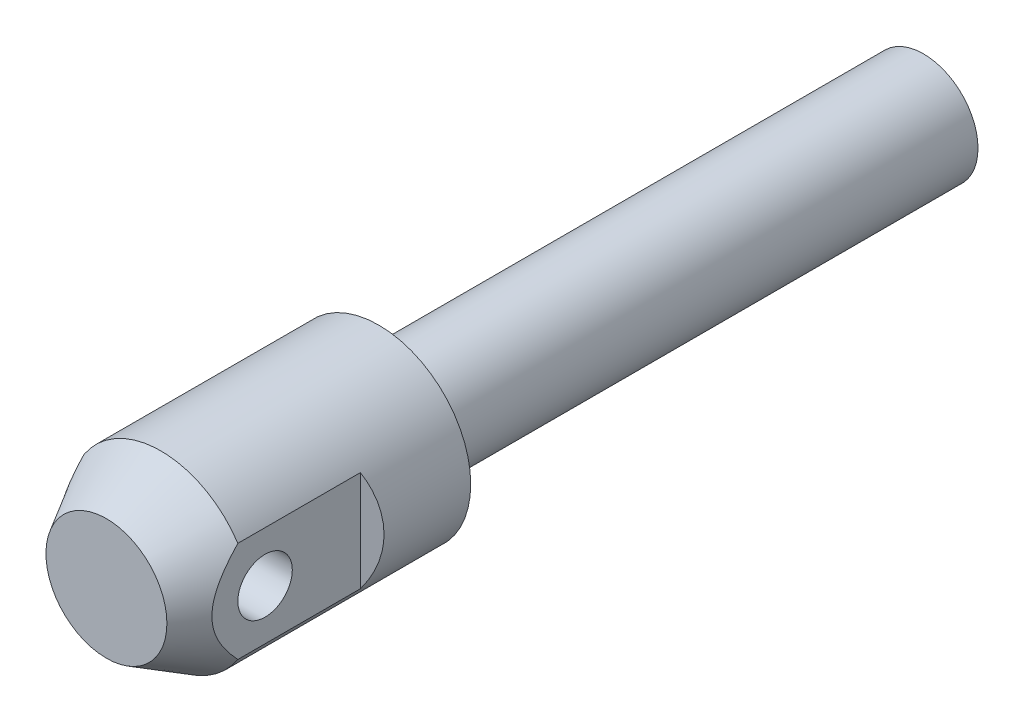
ISO-10303-21;
HEADER;
FILE_DESCRIPTION(('STEP AP214'),'2;1');
FILE_NAME('part.step','',(''),(''),'','','');
FILE_SCHEMA(('AUTOMOTIVE_DESIGN { 1 0 10303 214 1 1 1 1 }'));
ENDSEC;
DATA;
#1=APPLICATION_CONTEXT('core data for automotive mechanical design processes');
#2=APPLICATION_PROTOCOL_DEFINITION('international standard','automotive_design',2000,#1);
#3=PRODUCT_CONTEXT('',#1,'mechanical');
#4=PRODUCT('Part','Part','',(#3));
#5=PRODUCT_RELATED_PRODUCT_CATEGORY('part','',(#4));
#6=PRODUCT_DEFINITION_FORMATION('','',#4);
#7=PRODUCT_DEFINITION_CONTEXT('part definition',#1,'design');
#8=PRODUCT_DEFINITION('design','',#6,#7);
#9=PRODUCT_DEFINITION_SHAPE('','',#8);
#10=(LENGTH_UNIT() NAMED_UNIT(*) SI_UNIT(.MILLI.,.METRE.));
#11=(NAMED_UNIT(*) PLANE_ANGLE_UNIT() SI_UNIT($,.RADIAN.));
#12=(NAMED_UNIT(*) SI_UNIT($,.STERADIAN.) SOLID_ANGLE_UNIT());
#13=UNCERTAINTY_MEASURE_WITH_UNIT(LENGTH_MEASURE(1.E-05),#10,'distance_accuracy_value','');
#14=(GEOMETRIC_REPRESENTATION_CONTEXT(3) GLOBAL_UNCERTAINTY_ASSIGNED_CONTEXT((#13)) GLOBAL_UNIT_ASSIGNED_CONTEXT((#10,
#11,#12)) REPRESENTATION_CONTEXT('',''));
#15=CARTESIAN_POINT('',(0.,0.,0.));
#16=DIRECTION('',(0.,0.,1.));
#17=DIRECTION('',(1.,0.,0.));
#18=AXIS2_PLACEMENT_3D('',#15,#16,#17);
#19=CARTESIAN_POINT('',(0.,0.,20.));
#20=DIRECTION('',(0.,0.,1.));
#21=DIRECTION('',(1.,0.,0.));
#22=AXIS2_PLACEMENT_3D('',#19,#20,#21);
#23=CYLINDRICAL_SURFACE('',#22,13.5);
#24=CARTESIAN_POINT('',(0.,0.,0.));
#25=DIRECTION('',(0.,0.,1.));
#26=DIRECTION('',(1.,0.,0.));
#27=AXIS2_PLACEMENT_3D('',#24,#25,#26);
#28=CIRCLE('',#27,13.5);
#29=CARTESIAN_POINT('',(13.5,0.,0.));
#30=VERTEX_POINT('',#29);
#31=EDGE_CURVE('E82',#30,#30,#28,.T.);
#32=ORIENTED_EDGE('',*,*,#31,.T.);
#33=EDGE_LOOP('',(#32));
#34=FACE_BOUND('',#33,.T.);
#35=CARTESIAN_POINT('',(0.,0.,32.));
#36=DIRECTION('',(0.,0.,1.));
#37=DIRECTION('',(1.,0.,0.));
#38=AXIS2_PLACEMENT_3D('',#35,#36,#37);
#39=CIRCLE('',#38,13.5);
#40=CARTESIAN_POINT('',(-11.3,-7.38647412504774,32.));
#41=VERTEX_POINT('',#40);
#42=CARTESIAN_POINT('',(11.3,-7.38647412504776,32.));
#43=VERTEX_POINT('',#42);
#44=EDGE_CURVE('E67',#41,#43,#39,.T.);
#45=ORIENTED_EDGE('',*,*,#44,.F.);
#46=DIRECTION('',(0.,0.,1.));
#47=VECTOR('',#46,1.);
#48=CARTESIAN_POINT('',(-11.3,-7.38647412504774,20.));
#49=LINE('',#48,#47);
#50=CARTESIAN_POINT('',(-11.3,-7.38647412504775,14.));
#51=VERTEX_POINT('',#50);
#52=EDGE_CURVE('E30',#41,#51,#49,.F.);
#53=ORIENTED_EDGE('',*,*,#52,.T.);
#54=CARTESIAN_POINT('',(0.,0.,20.5240580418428));
#55=DIRECTION('',(0.5,0.,-0.866025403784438));
#56=DIRECTION('',(0.866025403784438,0.,0.5));
#57=AXIS2_PLACEMENT_3D('',#54,#55,#56);
#58=ELLIPSE('',#57,15.5884572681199,13.5);
#59=CARTESIAN_POINT('',(-11.3,7.38647412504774,14.));
#60=VERTEX_POINT('',#59);
#61=EDGE_CURVE('E9',#60,#51,#58,.F.);
#62=ORIENTED_EDGE('',*,*,#61,.F.);
#63=DIRECTION('',(0.,0.,1.));
#64=VECTOR('',#63,1.);
#65=CARTESIAN_POINT('',(-11.3,7.38647412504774,20.));
#66=LINE('',#65,#64);
#67=CARTESIAN_POINT('',(-11.3,7.38647412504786,32.));
#68=VERTEX_POINT('',#67);
#69=EDGE_CURVE('E63',#60,#68,#66,.T.);
#70=ORIENTED_EDGE('',*,*,#69,.T.);
#71=CARTESIAN_POINT('',(11.3,7.38647412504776,32.));
#72=VERTEX_POINT('',#71);
#73=EDGE_CURVE('E79',#72,#68,#39,.T.);
#74=ORIENTED_EDGE('',*,*,#73,.F.);
#75=DIRECTION('',(0.,0.,1.));
#76=VECTOR('',#75,1.);
#77=CARTESIAN_POINT('',(11.3,7.38647412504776,20.));
#78=LINE('',#77,#76);
#79=CARTESIAN_POINT('',(11.3,7.38647412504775,14.));
#80=VERTEX_POINT('',#79);
#81=EDGE_CURVE('E38',#80,#72,#78,.T.);
#82=ORIENTED_EDGE('',*,*,#81,.F.);
#83=CARTESIAN_POINT('',(0.,0.,20.5240580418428));
#84=DIRECTION('',(0.5,0.,0.866025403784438));
#85=DIRECTION('',(-0.866025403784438,0.,0.5));
#86=AXIS2_PLACEMENT_3D('',#83,#84,#85);
#87=ELLIPSE('',#86,15.5884572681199,13.5);
#88=CARTESIAN_POINT('',(11.3,-7.38647412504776,14.));
#89=VERTEX_POINT('',#88);
#90=EDGE_CURVE('E99',#80,#89,#87,.F.);
#91=ORIENTED_EDGE('',*,*,#90,.T.);
#92=DIRECTION('',(0.,0.,1.));
#93=VECTOR('',#92,1.);
#94=CARTESIAN_POINT('',(11.3,-7.38647412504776,20.));
#95=LINE('',#94,#93);
#96=EDGE_CURVE('E74',#43,#89,#95,.F.);
#97=ORIENTED_EDGE('',*,*,#96,.F.);
#98=EDGE_LOOP('',(#45,#53,#62,#70,#74,#82,#91,#97));
#99=FACE_BOUND('',#98,.T.);
#100=ADVANCED_FACE('F14',(#34,#99),#23,.T.);
#101=CARTESIAN_POINT('',(0.,0.,40.));
#102=DIRECTION('',(0.,0.,-1.));
#103=DIRECTION('',(-1.,0.,0.));
#104=AXIS2_PLACEMENT_3D('',#101,#102,#103);
#105=CONICAL_SURFACE('',#104,8.88119784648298,0.523598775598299);
#106=CARTESIAN_POINT('',(0.,0.,40.));
#107=DIRECTION('',(0.,0.,1.));
#108=DIRECTION('',(1.,0.,0.));
#109=AXIS2_PLACEMENT_3D('',#106,#107,#108);
#110=CIRCLE('',#109,8.88119784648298);
#111=CARTESIAN_POINT('',(8.88119784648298,0.,40.));
#112=VERTEX_POINT('',#111);
#113=EDGE_CURVE('E76',#112,#112,#110,.T.);
#114=ORIENTED_EDGE('',*,*,#113,.F.);
#115=EDGE_LOOP('',(#114));
#116=FACE_BOUND('',#115,.T.);
#117=ORIENTED_EDGE('',*,*,#73,.T.);
#118=CARTESIAN_POINT('',(-11.3,-18.8347178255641,17.3391610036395));
#119=CARTESIAN_POINT('',(-11.3,-18.6312428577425,17.6413684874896));
#120=CARTESIAN_POINT('',(-11.3,-18.4271713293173,17.9431740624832));
#121=CARTESIAN_POINT('',(-11.3,-18.0177145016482,18.5458952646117));
#122=CARTESIAN_POINT('',(-11.3,-17.8123291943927,18.8468108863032));
#123=CARTESIAN_POINT('',(-11.3,-17.1939628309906,19.7481792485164));
#124=CARTESIAN_POINT('',(-11.3,-16.7788329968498,20.3471617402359));
#125=CARTESIAN_POINT('',(-11.3,-15.9388099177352,21.5443219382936));
#126=CARTESIAN_POINT('',(-11.3,-15.5138695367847,22.1424666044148));
#127=CARTESIAN_POINT('',(-11.3,-14.6554077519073,23.3325086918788));
#128=CARTESIAN_POINT('',(-11.3,-14.2218871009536,23.9244066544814));
#129=CARTESIAN_POINT('',(-11.3,-13.5436857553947,24.8328000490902));
#130=CARTESIAN_POINT('',(-11.3,-13.3027889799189,25.1521216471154));
#131=CARTESIAN_POINT('',(-11.3,-12.817342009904,25.7879734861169));
#132=CARTESIAN_POINT('',(-11.3,-12.5727918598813,26.1045037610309));
#133=CARTESIAN_POINT('',(-11.3,-12.0794340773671,26.7343911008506));
#134=CARTESIAN_POINT('',(-11.3,-11.8306251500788,27.0477471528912));
#135=CARTESIAN_POINT('',(-11.3,-11.3281887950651,27.6705730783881));
#136=CARTESIAN_POINT('',(-11.3,-11.0745614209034,27.9800429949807));
#137=CARTESIAN_POINT('',(-11.3,-10.562504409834,28.5933750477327));
#138=CARTESIAN_POINT('',(-11.3,-10.3040919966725,28.8972515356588));
#139=CARTESIAN_POINT('',(-11.3,-9.78075923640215,29.4993915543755));
#140=CARTESIAN_POINT('',(-11.3,-9.51583855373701,29.7976547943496));
#141=CARTESIAN_POINT('',(-11.3,-8.97850518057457,30.3870660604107));
#142=CARTESIAN_POINT('',(-11.3,-8.70609677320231,30.6782179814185));
#143=CARTESIAN_POINT('',(-11.3,-8.15226385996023,31.2517878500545));
#144=CARTESIAN_POINT('',(-11.3,-7.87084075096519,31.5342071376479));
#145=CARTESIAN_POINT('',(-11.3,-7.43161505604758,31.9581511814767));
#146=CARTESIAN_POINT('',(-11.3,-7.27767803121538,32.1036859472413));
#147=CARTESIAN_POINT('',(-11.3,-6.96643973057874,32.3911264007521));
#148=CARTESIAN_POINT('',(-11.3,-6.80913839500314,32.5330320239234));
#149=CARTESIAN_POINT('',(-11.3,-6.49073908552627,32.8127380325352));
#150=CARTESIAN_POINT('',(-11.3,-6.32963877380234,32.950535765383));
#151=CARTESIAN_POINT('',(-11.3,-6.00337830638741,33.2212274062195));
#152=CARTESIAN_POINT('',(-11.3,-5.83821820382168,33.3541213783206));
#153=CARTESIAN_POINT('',(-11.3,-5.33951549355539,33.7415816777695));
#154=CARTESIAN_POINT('',(-11.3,-4.99944271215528,33.9878762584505));
#155=CARTESIAN_POINT('',(-11.3,-4.29895012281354,34.4494867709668));
#156=CARTESIAN_POINT('',(-11.3,-3.93855400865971,34.6648377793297));
#157=CARTESIAN_POINT('',(-11.3,-3.3812134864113,34.9553996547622));
#158=CARTESIAN_POINT('',(-11.3,-3.19269992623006,35.0468208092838));
#159=CARTESIAN_POINT('',(-11.3,-2.80999688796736,35.2169818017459));
#160=CARTESIAN_POINT('',(-11.3,-2.61580786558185,35.2957226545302));
#161=CARTESIAN_POINT('',(-11.3,-2.22226428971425,35.4384010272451));
#162=CARTESIAN_POINT('',(-11.3,-2.02291566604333,35.5023547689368));
#163=CARTESIAN_POINT('',(-11.3,-1.61961078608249,35.6135025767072));
#164=CARTESIAN_POINT('',(-11.3,-1.41565578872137,35.660701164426));
#165=CARTESIAN_POINT('',(-11.3,-1.00178639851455,35.7370181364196));
#166=CARTESIAN_POINT('',(-11.3,-0.791829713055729,35.7659099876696));
#167=CARTESIAN_POINT('',(-11.3,-0.370107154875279,35.8034123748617));
#168=CARTESIAN_POINT('',(-11.3,-0.158341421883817,35.8120244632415));
#169=CARTESIAN_POINT('',(-11.3,0.264860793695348,35.8085643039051));
#170=CARTESIAN_POINT('',(-11.3,0.476297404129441,35.7965076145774));
#171=CARTESIAN_POINT('',(-11.3,0.89705334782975,35.752308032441));
#172=CARTESIAN_POINT('',(-11.3,1.10637243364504,35.7201628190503));
#173=CARTESIAN_POINT('',(-11.3,1.54335102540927,35.6327533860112));
#174=CARTESIAN_POINT('',(-11.3,1.77058831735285,35.5753907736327));
#175=CARTESIAN_POINT('',(-11.3,2.21897916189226,35.4403905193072));
#176=CARTESIAN_POINT('',(-11.3,2.44013000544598,35.3627440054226));
#177=CARTESIAN_POINT('',(-11.3,2.87756331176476,35.1892771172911));
#178=CARTESIAN_POINT('',(-11.3,3.09377912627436,35.0932902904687));
#179=CARTESIAN_POINT('',(-11.3,3.51889359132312,34.8865164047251));
#180=CARTESIAN_POINT('',(-11.3,3.72779359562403,34.7757321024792));
#181=CARTESIAN_POINT('',(-11.3,4.17858760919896,34.5190685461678));
#182=CARTESIAN_POINT('',(-11.3,4.41897628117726,34.3705576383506));
#183=CARTESIAN_POINT('',(-11.3,4.89052940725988,34.0594779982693));
#184=CARTESIAN_POINT('',(-11.3,5.12169003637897,33.8969035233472));
#185=CARTESIAN_POINT('',(-11.3,5.57632851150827,33.5600071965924));
#186=CARTESIAN_POINT('',(-11.3,5.7997808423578,33.3856511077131));
#187=CARTESIAN_POINT('',(-11.3,6.23918051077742,33.0278349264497));
#188=CARTESIAN_POINT('',(-11.3,6.45512894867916,32.8443761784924));
#189=CARTESIAN_POINT('',(-11.3,6.87086380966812,32.4784380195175));
#190=CARTESIAN_POINT('',(-11.3,7.07094011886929,32.2962865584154));
#191=CARTESIAN_POINT('',(-11.3,7.46579297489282,31.9263110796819));
#192=CARTESIAN_POINT('',(-11.3,7.66056910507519,31.7384866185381));
#193=CARTESIAN_POINT('',(-11.3,8.04396867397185,31.359521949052));
#194=CARTESIAN_POINT('',(-11.3,8.23262736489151,31.168417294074));
#195=CARTESIAN_POINT('',(-11.3,8.60576056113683,30.7822648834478));
#196=CARTESIAN_POINT('',(-11.3,8.79023621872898,30.5872182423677));
#197=CARTESIAN_POINT('',(-11.3,8.97289829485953,30.3905128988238));
#198=B_SPLINE_CURVE_WITH_KNOTS('',3,(#118,#119,#120,#121,#122,#123,#124,#125,#126,#127,#128,
#129,#130,#131,#132,#133,#134,#135,#136,#137,#138,#139,#140,#141,#142,#143,#144,#145,#146,#147,
#148,#149,#150,#151,#152,#153,#154,#155,#156,#157,#158,#159,#160,#161,#162,#163,#164,#165,#166,
#167,#168,#169,#170,#171,#172,#173,#174,#175,#176,#177,#178,#179,#180,#181,#182,#183,#184,#185,
#186,#187,#188,#189,#190,#191,#192,#193,#194,#195,#196,#197),.UNSPECIFIED.,.F.,.F.,(4,2,2,2,2,2,
2,2,2,2,2,2,2,2,2,2,2,2,2,2,2,2,2,2,2,2,2,2,2,2,2,2,2,2,2,2,2,2,2,4),(0.,1.09296825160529,
2.18594317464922,4.37222463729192,6.57334120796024,8.77426546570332,9.97423505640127,
11.1741900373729,12.3745165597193,13.5748297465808,14.7714409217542,15.9681139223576,
17.1641160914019,18.3599338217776,18.9954120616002,19.6309016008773,20.2667929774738,
20.9026760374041,22.1611709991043,23.418227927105,24.0463884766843,24.6744987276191,
25.301916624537,25.9291650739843,26.5640310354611,27.1988483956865,27.833188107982,
28.4676011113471,29.1696109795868,29.8719284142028,30.5809518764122,31.2898434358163,
32.1369066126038,32.9843173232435,33.8343063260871,34.6841701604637,35.4957618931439,
36.3074172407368,37.1129692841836,37.9182966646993),.UNSPECIFIED.);
#199=EDGE_CURVE('E23',#68,#41,#198,.F.);
#200=ORIENTED_EDGE('',*,*,#199,.T.);
#201=ORIENTED_EDGE('',*,*,#44,.T.);
#202=CARTESIAN_POINT('',(11.3,-18.8347178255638,17.3391610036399));
#203=CARTESIAN_POINT('',(11.3,-18.6312428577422,17.6413684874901));
#204=CARTESIAN_POINT('',(11.3,-18.4271713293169,17.9431740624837));
#205=CARTESIAN_POINT('',(11.3,-18.0177145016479,18.5458952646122));
#206=CARTESIAN_POINT('',(11.3,-17.8123291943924,18.8468108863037));
#207=CARTESIAN_POINT('',(11.3,-17.1939628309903,19.7481792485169));
#208=CARTESIAN_POINT('',(11.3,-16.7788329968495,20.3471617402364));
#209=CARTESIAN_POINT('',(11.3,-15.9388099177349,21.544321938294));
#210=CARTESIAN_POINT('',(11.3,-15.5138695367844,22.1424666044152));
#211=CARTESIAN_POINT('',(11.3,-14.655407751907,23.3325086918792));
#212=CARTESIAN_POINT('',(11.3,-14.2218871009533,23.9244066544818));
#213=CARTESIAN_POINT('',(11.3,-13.5436857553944,24.8328000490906));
#214=CARTESIAN_POINT('',(11.3,-13.3027889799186,25.1521216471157));
#215=CARTESIAN_POINT('',(11.3,-12.8173420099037,25.7879734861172));
#216=CARTESIAN_POINT('',(11.3,-12.5727918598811,26.1045037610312));
#217=CARTESIAN_POINT('',(11.3,-12.0794340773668,26.7343911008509));
#218=CARTESIAN_POINT('',(11.3,-11.8306251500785,27.0477471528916));
#219=CARTESIAN_POINT('',(11.3,-11.3281887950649,27.6705730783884));
#220=CARTESIAN_POINT('',(11.3,-11.0745614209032,27.980042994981));
#221=CARTESIAN_POINT('',(11.3,-10.5625044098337,28.593375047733));
#222=CARTESIAN_POINT('',(11.3,-10.3040919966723,28.8972515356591));
#223=CARTESIAN_POINT('',(11.3,-9.78075923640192,29.4993915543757));
#224=CARTESIAN_POINT('',(11.3,-9.51583855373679,29.7976547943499));
#225=CARTESIAN_POINT('',(11.3,-8.97850518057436,30.3870660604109));
#226=CARTESIAN_POINT('',(11.3,-8.70609677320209,30.6782179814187));
#227=CARTESIAN_POINT('',(11.3,-8.15226385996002,31.2517878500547));
#228=CARTESIAN_POINT('',(11.3,-7.87084075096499,31.5342071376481));
#229=CARTESIAN_POINT('',(11.3,-7.4316150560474,31.9581511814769));
#230=CARTESIAN_POINT('',(11.3,-7.27767803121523,32.1036859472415));
#231=CARTESIAN_POINT('',(11.3,-6.96643973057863,32.3911264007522));
#232=CARTESIAN_POINT('',(11.3,-6.80913839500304,32.5330320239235));
#233=CARTESIAN_POINT('',(11.3,-6.49073908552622,32.8127380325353));
#234=CARTESIAN_POINT('',(11.3,-6.3296387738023,32.950535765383));
#235=CARTESIAN_POINT('',(11.3,-6.00337830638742,33.2212274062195));
#236=CARTESIAN_POINT('',(11.3,-5.83821820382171,33.3541213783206));
#237=CARTESIAN_POINT('',(11.3,-5.33951549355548,33.7415816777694));
#238=CARTESIAN_POINT('',(11.3,-4.99944271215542,33.9878762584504));
#239=CARTESIAN_POINT('',(11.3,-4.2989501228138,34.4494867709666));
#240=CARTESIAN_POINT('',(11.3,-3.93855400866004,34.6648377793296));
#241=CARTESIAN_POINT('',(11.3,-3.38121348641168,34.955399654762));
#242=CARTESIAN_POINT('',(11.3,-3.19269992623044,35.0468208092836));
#243=CARTESIAN_POINT('',(11.3,-2.80999688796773,35.2169818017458));
#244=CARTESIAN_POINT('',(11.3,-2.61580786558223,35.2957226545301));
#245=CARTESIAN_POINT('',(11.3,-2.22226428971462,35.438401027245));
#246=CARTESIAN_POINT('',(11.3,-2.0229156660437,35.5023547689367));
#247=CARTESIAN_POINT('',(11.3,-1.61961078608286,35.6135025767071));
#248=CARTESIAN_POINT('',(11.3,-1.41565578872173,35.6607011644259));
#249=CARTESIAN_POINT('',(11.3,-1.0017863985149,35.7370181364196));
#250=CARTESIAN_POINT('',(11.3,-0.791829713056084,35.7659099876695));
#251=CARTESIAN_POINT('',(11.3,-0.370107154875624,35.8034123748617));
#252=CARTESIAN_POINT('',(11.3,-0.158341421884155,35.8120244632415));
#253=CARTESIAN_POINT('',(11.3,0.26486079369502,35.8085643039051));
#254=CARTESIAN_POINT('',(11.3,0.476297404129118,35.7965076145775));
#255=CARTESIAN_POINT('',(11.3,0.897053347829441,35.7523080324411));
#256=CARTESIAN_POINT('',(11.3,1.10637243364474,35.7201628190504));
#257=CARTESIAN_POINT('',(11.3,1.54335102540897,35.6327533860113));
#258=CARTESIAN_POINT('',(11.3,1.77058831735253,35.5753907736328));
#259=CARTESIAN_POINT('',(11.3,2.21897916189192,35.4403905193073));
#260=CARTESIAN_POINT('',(11.3,2.44013000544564,35.3627440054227));
#261=CARTESIAN_POINT('',(11.3,2.8775633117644,35.1892771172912));
#262=CARTESIAN_POINT('',(11.3,3.09377912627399,35.0932902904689));
#263=CARTESIAN_POINT('',(11.3,3.51889359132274,34.8865164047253));
#264=CARTESIAN_POINT('',(11.3,3.72779359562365,34.7757321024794));
#265=CARTESIAN_POINT('',(11.3,4.17858760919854,34.5190685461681));
#266=CARTESIAN_POINT('',(11.3,4.4189762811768,34.3705576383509));
#267=CARTESIAN_POINT('',(11.3,4.89052940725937,34.0594779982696));
#268=CARTESIAN_POINT('',(11.3,5.12169003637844,33.8969035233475));
#269=CARTESIAN_POINT('',(11.3,5.5763285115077,33.5600071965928));
#270=CARTESIAN_POINT('',(11.3,5.7997808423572,33.3856511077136));
#271=CARTESIAN_POINT('',(11.3,6.23918051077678,33.0278349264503));
#272=CARTESIAN_POINT('',(11.3,6.45512894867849,32.8443761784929));
#273=CARTESIAN_POINT('',(11.3,6.87086380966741,32.4784380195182));
#274=CARTESIAN_POINT('',(11.3,7.07094011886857,32.2962865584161));
#275=CARTESIAN_POINT('',(11.3,7.46579297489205,31.9263110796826));
#276=CARTESIAN_POINT('',(11.3,7.6605691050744,31.7384866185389));
#277=CARTESIAN_POINT('',(11.3,8.04396867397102,31.3595219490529));
#278=CARTESIAN_POINT('',(11.3,8.23262736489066,31.1684172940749));
#279=CARTESIAN_POINT('',(11.3,8.60576056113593,30.7822648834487));
#280=CARTESIAN_POINT('',(11.3,8.79023621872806,30.5872182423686));
#281=CARTESIAN_POINT('',(11.3,8.97289829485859,30.3905128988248));
#282=B_SPLINE_CURVE_WITH_KNOTS('',3,(#202,#203,#204,#205,#206,#207,#208,#209,#210,#211,#212,
#213,#214,#215,#216,#217,#218,#219,#220,#221,#222,#223,#224,#225,#226,#227,#228,#229,#230,#231,
#232,#233,#234,#235,#236,#237,#238,#239,#240,#241,#242,#243,#244,#245,#246,#247,#248,#249,#250,
#251,#252,#253,#254,#255,#256,#257,#258,#259,#260,#261,#262,#263,#264,#265,#266,#267,#268,#269,
#270,#271,#272,#273,#274,#275,#276,#277,#278,#279,#280,#281),.UNSPECIFIED.,.F.,.F.,(4,2,2,2,2,2,
2,2,2,2,2,2,2,2,2,2,2,2,2,2,2,2,2,2,2,2,2,2,2,2,2,2,2,2,2,2,2,2,2,4),(0.,1.09296825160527,
2.18594317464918,4.37222463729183,6.57334120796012,8.77426546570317,9.97423505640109,
11.1741900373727,12.3745165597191,13.5748297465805,14.7714409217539,15.9681139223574,
17.1641160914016,18.3599338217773,18.9954120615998,19.6309016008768,20.2667929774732,
20.9026760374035,22.1611709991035,23.4182279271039,24.0463884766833,24.6744987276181,
25.3019166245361,25.9291650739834,26.5640310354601,27.1988483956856,27.8331881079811,
28.4676011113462,29.1696109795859,29.8719284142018,30.5809518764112,31.2898434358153,
32.1369066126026,32.9843173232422,33.8343063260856,34.6841701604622,35.4957618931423,
36.307417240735,37.1129692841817,37.9182966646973),.UNSPECIFIED.);
#283=EDGE_CURVE('E91',#72,#43,#282,.F.);
#284=ORIENTED_EDGE('',*,*,#283,.F.);
#285=EDGE_LOOP('',(#117,#200,#201,#284));
#286=FACE_BOUND('',#285,.T.);
#287=ADVANCED_FACE('F104',(#116,#286),#105,.T.);
#288=CARTESIAN_POINT('',(0.,8.88119784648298,40.));
#289=DIRECTION('',(0.,0.,-1.));
#290=DIRECTION('',(-1.,0.,0.));
#291=AXIS2_PLACEMENT_3D('',#288,#289,#290);
#292=PLANE('',#291);
#293=ORIENTED_EDGE('',*,*,#113,.T.);
#294=EDGE_LOOP('',(#293));
#295=FACE_BOUND('',#294,.T.);
#296=ADVANCED_FACE('F16',(#295),#292,.F.);
#297=CARTESIAN_POINT('',(0.,8.,-80.));
#298=DIRECTION('',(0.,0.,-1.));
#299=DIRECTION('',(-1.,0.,0.));
#300=AXIS2_PLACEMENT_3D('',#297,#298,#299);
#301=PLANE('',#300);
#302=CARTESIAN_POINT('',(0.,0.,-80.));
#303=DIRECTION('',(0.,0.,1.));
#304=DIRECTION('',(1.,0.,0.));
#305=AXIS2_PLACEMENT_3D('',#302,#303,#304);
#306=CIRCLE('',#305,8.);
#307=CARTESIAN_POINT('',(8.,0.,-80.));
#308=VERTEX_POINT('',#307);
#309=EDGE_CURVE('E88',#308,#308,#306,.T.);
#310=ORIENTED_EDGE('',*,*,#309,.F.);
#311=EDGE_LOOP('',(#310));
#312=FACE_BOUND('',#311,.T.);
#313=ADVANCED_FACE('F147',(#312),#301,.T.);
#314=CARTESIAN_POINT('',(0.,0.,20.));
#315=DIRECTION('',(0.,0.,1.));
#316=DIRECTION('',(1.,0.,0.));
#317=AXIS2_PLACEMENT_3D('',#314,#315,#316);
#318=CYLINDRICAL_SURFACE('',#317,8.);
#319=ORIENTED_EDGE('',*,*,#309,.T.);
#320=EDGE_LOOP('',(#319));
#321=FACE_BOUND('',#320,.T.);
#322=CARTESIAN_POINT('',(0.,0.,0.));
#323=DIRECTION('',(0.,0.,1.));
#324=DIRECTION('',(1.,0.,0.));
#325=AXIS2_PLACEMENT_3D('',#322,#323,#324);
#326=CIRCLE('',#325,8.);
#327=CARTESIAN_POINT('',(8.,0.,0.));
#328=VERTEX_POINT('',#327);
#329=EDGE_CURVE('E85',#328,#328,#326,.T.);
#330=ORIENTED_EDGE('',*,*,#329,.F.);
#331=EDGE_LOOP('',(#330));
#332=FACE_BOUND('',#331,.T.);
#333=ADVANCED_FACE('F134',(#321,#332),#318,.T.);
#334=CARTESIAN_POINT('',(0.,8.,0.));
#335=DIRECTION('',(0.,0.,1.));
#336=DIRECTION('',(1.,0.,0.));
#337=AXIS2_PLACEMENT_3D('',#334,#335,#336);
#338=PLANE('',#337);
#339=ORIENTED_EDGE('',*,*,#31,.F.);
#340=EDGE_LOOP('',(#339));
#341=FACE_BOUND('',#340,.T.);
#342=ORIENTED_EDGE('',*,*,#329,.T.);
#343=EDGE_LOOP('',(#342));
#344=FACE_BOUND('',#343,.T.);
#345=ADVANCED_FACE('F125',(#341,#344),#338,.F.);
#346=CARTESIAN_POINT('',(11.3,-15.,14.));
#347=DIRECTION('',(0.5,0.,0.866025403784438));
#348=DIRECTION('',(0.866025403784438,0.,-0.5));
#349=AXIS2_PLACEMENT_3D('',#346,#347,#348);
#350=PLANE('',#349);
#351=DIRECTION('',(0.,1.,0.));
#352=VECTOR('',#351,1.);
#353=CARTESIAN_POINT('',(11.3,-15.,14.));
#354=LINE('',#353,#352);
#355=EDGE_CURVE('E68',#89,#80,#354,.T.);
#356=ORIENTED_EDGE('',*,*,#355,.F.);
#357=ORIENTED_EDGE('',*,*,#90,.F.);
#358=EDGE_LOOP('',(#356,#357));
#359=FACE_BOUND('',#358,.T.);
#360=ADVANCED_FACE('F123',(#359),#350,.T.);
#361=CARTESIAN_POINT('',(11.3,-15.,14.));
#362=DIRECTION('',(-1.,0.,0.));
#363=DIRECTION('',(0.,0.,1.));
#364=AXIS2_PLACEMENT_3D('',#361,#362,#363);
#365=PLANE('',#364);
#366=CARTESIAN_POINT('',(11.3,0.,28.));
#367=DIRECTION('',(1.,0.,0.));
#368=DIRECTION('',(0.,0.,-1.));
#369=AXIS2_PLACEMENT_3D('',#366,#367,#368);
#370=CIRCLE('',#369,4.);
#371=CARTESIAN_POINT('',(11.3,0.,24.));
#372=VERTEX_POINT('',#371);
#373=EDGE_CURVE('E233',#372,#372,#370,.T.);
#374=ORIENTED_EDGE('',*,*,#373,.F.);
#375=EDGE_LOOP('',(#374));
#376=FACE_BOUND('',#375,.T.);
#377=ORIENTED_EDGE('',*,*,#96,.T.);
#378=ORIENTED_EDGE('',*,*,#355,.T.);
#379=ORIENTED_EDGE('',*,*,#81,.T.);
#380=ORIENTED_EDGE('',*,*,#283,.T.);
#381=EDGE_LOOP('',(#377,#378,#379,#380));
#382=FACE_BOUND('',#381,.T.);
#383=ADVANCED_FACE('F101',(#376,#382),#365,.F.);
#384=CARTESIAN_POINT('',(-11.3,-15.,14.));
#385=DIRECTION('',(-1.,0.,0.));
#386=DIRECTION('',(0.,0.,1.));
#387=AXIS2_PLACEMENT_3D('',#384,#385,#386);
#388=PLANE('',#387);
#389=CARTESIAN_POINT('',(-11.3,0.,28.));
#390=DIRECTION('',(-1.,0.,0.));
#391=DIRECTION('',(0.,0.,1.));
#392=AXIS2_PLACEMENT_3D('',#389,#390,#391);
#393=CIRCLE('',#392,4.);
#394=CARTESIAN_POINT('',(-11.3,0.,32.));
#395=VERTEX_POINT('',#394);
#396=EDGE_CURVE('E18',#395,#395,#393,.T.);
#397=ORIENTED_EDGE('',*,*,#396,.F.);
#398=EDGE_LOOP('',(#397));
#399=FACE_BOUND('',#398,.T.);
#400=ORIENTED_EDGE('',*,*,#199,.F.);
#401=ORIENTED_EDGE('',*,*,#69,.F.);
#402=DIRECTION('',(0.,1.,0.));
#403=VECTOR('',#402,1.);
#404=CARTESIAN_POINT('',(-11.3,-15.,14.));
#405=LINE('',#404,#403);
#406=EDGE_CURVE('E59',#51,#60,#405,.T.);
#407=ORIENTED_EDGE('',*,*,#406,.F.);
#408=ORIENTED_EDGE('',*,*,#52,.F.);
#409=EDGE_LOOP('',(#400,#401,#407,#408));
#410=FACE_BOUND('',#409,.T.);
#411=ADVANCED_FACE('F62',(#399,#410),#388,.T.);
#412=CARTESIAN_POINT('',(-11.3,-15.,14.));
#413=DIRECTION('',(0.5,0.,-0.866025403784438));
#414=DIRECTION('',(-0.866025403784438,0.,-0.5));
#415=AXIS2_PLACEMENT_3D('',#412,#413,#414);
#416=PLANE('',#415);
#417=ORIENTED_EDGE('',*,*,#61,.T.);
#418=ORIENTED_EDGE('',*,*,#406,.T.);
#419=EDGE_LOOP('',(#417,#418));
#420=FACE_BOUND('',#419,.T.);
#421=ADVANCED_FACE('F58',(#420),#416,.F.);
#422=CARTESIAN_POINT('',(-13.5,0.,28.));
#423=DIRECTION('',(1.,0.,0.));
#424=DIRECTION('',(0.,0.,-1.));
#425=AXIS2_PLACEMENT_3D('',#422,#423,#424);
#426=CYLINDRICAL_SURFACE('',#425,4.);
#427=ORIENTED_EDGE('',*,*,#396,.T.);
#428=EDGE_LOOP('',(#427));
#429=FACE_BOUND('',#428,.T.);
#430=ORIENTED_EDGE('',*,*,#373,.T.);
#431=EDGE_LOOP('',(#430));
#432=FACE_BOUND('',#431,.T.);
#433=ADVANCED_FACE('F121',(#429,#432),#426,.F.);
#434=CLOSED_SHELL('',(#100,#287,#296,#313,#333,#345,#360,#383,#411,#421,#433));
#435=MANIFOLD_SOLID_BREP('B1',#434);
#436=ADVANCED_BREP_SHAPE_REPRESENTATION('',(#18,#435),#14);
#437=SHAPE_DEFINITION_REPRESENTATION(#9,#436);
ENDSEC;
END-ISO-10303-21;
